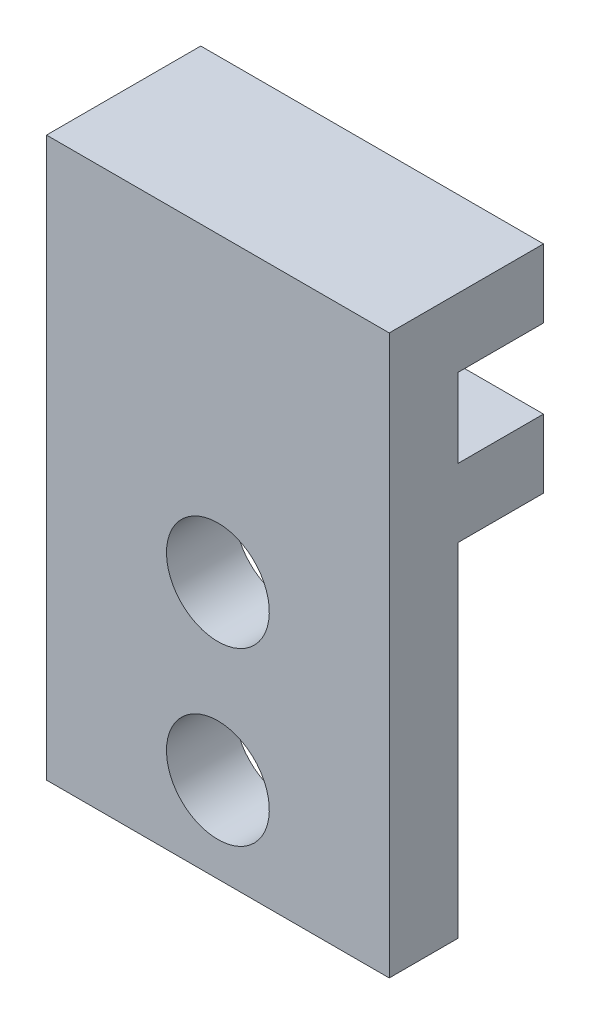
ISO-10303-21;
HEADER;
FILE_DESCRIPTION(('STEP AP214'),'2;1');
FILE_NAME('part.step','',(''),(''),'','','');
FILE_SCHEMA(('AUTOMOTIVE_DESIGN { 1 0 10303 214 1 1 1 1 }'));
ENDSEC;
DATA;
#1=APPLICATION_CONTEXT('core data for automotive mechanical design processes');
#2=APPLICATION_PROTOCOL_DEFINITION('international standard','automotive_design',2000,#1);
#3=PRODUCT_CONTEXT('',#1,'mechanical');
#4=PRODUCT('Part','Part','',(#3));
#5=PRODUCT_RELATED_PRODUCT_CATEGORY('part','',(#4));
#6=PRODUCT_DEFINITION_FORMATION('','',#4);
#7=PRODUCT_DEFINITION_CONTEXT('part definition',#1,'design');
#8=PRODUCT_DEFINITION('design','',#6,#7);
#9=PRODUCT_DEFINITION_SHAPE('','',#8);
#10=(LENGTH_UNIT() NAMED_UNIT(*) SI_UNIT(.MILLI.,.METRE.));
#11=(NAMED_UNIT(*) PLANE_ANGLE_UNIT() SI_UNIT($,.RADIAN.));
#12=(NAMED_UNIT(*) SI_UNIT($,.STERADIAN.) SOLID_ANGLE_UNIT());
#13=UNCERTAINTY_MEASURE_WITH_UNIT(LENGTH_MEASURE(1.E-05),#10,'distance_accuracy_value','');
#14=(GEOMETRIC_REPRESENTATION_CONTEXT(3) GLOBAL_UNCERTAINTY_ASSIGNED_CONTEXT((#13)) GLOBAL_UNIT_ASSIGNED_CONTEXT((#10,
#11,#12)) REPRESENTATION_CONTEXT('',''));
#15=CARTESIAN_POINT('',(0.,0.,0.));
#16=DIRECTION('',(0.,0.,1.));
#17=DIRECTION('',(1.,0.,0.));
#18=AXIS2_PLACEMENT_3D('',#15,#16,#17);
#19=CARTESIAN_POINT('',(20.,-32.6,0.));
#20=DIRECTION('',(0.,0.,-1.));
#21=DIRECTION('',(0.,1.,0.));
#22=AXIS2_PLACEMENT_3D('',#19,#20,#21);
#23=PLANE('',#22);
#24=CARTESIAN_POINT('',(10.,-17.6,0.));
#25=DIRECTION('',(0.,0.,-1.));
#26=DIRECTION('',(0.,1.,0.));
#27=AXIS2_PLACEMENT_3D('',#24,#25,#26);
#28=CIRCLE('',#27,3.);
#29=CARTESIAN_POINT('',(10.,-14.6,0.));
#30=VERTEX_POINT('',#29);
#31=EDGE_CURVE('E163',#30,#30,#28,.T.);
#32=ORIENTED_EDGE('',*,*,#31,.T.);
#33=EDGE_LOOP('',(#32));
#34=FACE_BOUND('',#33,.T.);
#35=CARTESIAN_POINT('',(10.,-27.6,0.));
#36=DIRECTION('',(0.,0.,-1.));
#37=DIRECTION('',(0.,1.,0.));
#38=AXIS2_PLACEMENT_3D('',#35,#36,#37);
#39=CIRCLE('',#38,3.);
#40=CARTESIAN_POINT('',(10.,-24.6,0.));
#41=VERTEX_POINT('',#40);
#42=EDGE_CURVE('E249',#41,#41,#39,.T.);
#43=ORIENTED_EDGE('',*,*,#42,.T.);
#44=EDGE_LOOP('',(#43));
#45=FACE_BOUND('',#44,.T.);
#46=DIRECTION('',(0.,-1.,0.));
#47=VECTOR('',#46,1.);
#48=CARTESIAN_POINT('',(0.,-32.6,0.));
#49=LINE('',#48,#47);
#50=CARTESIAN_POINT('',(0.,0.,0.));
#51=VERTEX_POINT('',#50);
#52=CARTESIAN_POINT('',(0.,-32.6,0.));
#53=VERTEX_POINT('',#52);
#54=EDGE_CURVE('E158',#51,#53,#49,.T.);
#55=ORIENTED_EDGE('',*,*,#54,.T.);
#56=DIRECTION('',(-1.,0.,0.));
#57=VECTOR('',#56,1.);
#58=CARTESIAN_POINT('',(20.,-32.6,0.));
#59=LINE('',#58,#57);
#60=CARTESIAN_POINT('',(20.,-32.6,0.));
#61=VERTEX_POINT('',#60);
#62=EDGE_CURVE('E11',#61,#53,#59,.T.);
#63=ORIENTED_EDGE('',*,*,#62,.F.);
#64=DIRECTION('',(0.,-1.,0.));
#65=VECTOR('',#64,1.);
#66=CARTESIAN_POINT('',(20.,-32.6,0.));
#67=LINE('',#66,#65);
#68=CARTESIAN_POINT('',(20.,0.,0.));
#69=VERTEX_POINT('',#68);
#70=EDGE_CURVE('E187',#69,#61,#67,.T.);
#71=ORIENTED_EDGE('',*,*,#70,.F.);
#72=DIRECTION('',(-1.,0.,0.));
#73=VECTOR('',#72,1.);
#74=CARTESIAN_POINT('',(20.,0.,0.));
#75=LINE('',#74,#73);
#76=EDGE_CURVE('E154',#69,#51,#75,.T.);
#77=ORIENTED_EDGE('',*,*,#76,.T.);
#78=EDGE_LOOP('',(#55,#63,#71,#77));
#79=FACE_BOUND('',#78,.T.);
#80=ADVANCED_FACE('F45',(#34,#45,#79),#23,.F.);
#81=CARTESIAN_POINT('',(20.,-32.6,-4.00000000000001));
#82=DIRECTION('',(0.,1.,0.));
#83=DIRECTION('',(0.,0.,1.));
#84=AXIS2_PLACEMENT_3D('',#81,#82,#83);
#85=PLANE('',#84);
#86=DIRECTION('',(0.,0.,-1.));
#87=VECTOR('',#86,1.);
#88=CARTESIAN_POINT('',(0.,-32.6,-4.00000000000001));
#89=LINE('',#88,#87);
#90=CARTESIAN_POINT('',(0.,-32.6,-4.00000000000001));
#91=VERTEX_POINT('',#90);
#92=EDGE_CURVE('E162',#53,#91,#89,.T.);
#93=ORIENTED_EDGE('',*,*,#92,.T.);
#94=DIRECTION('',(-1.,0.,0.));
#95=VECTOR('',#94,1.);
#96=CARTESIAN_POINT('',(20.,-32.6,-4.00000000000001));
#97=LINE('',#96,#95);
#98=CARTESIAN_POINT('',(20.,-32.6,-4.00000000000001));
#99=VERTEX_POINT('',#98);
#100=EDGE_CURVE('E54',#99,#91,#97,.T.);
#101=ORIENTED_EDGE('',*,*,#100,.F.);
#102=DIRECTION('',(0.,0.,-1.));
#103=VECTOR('',#102,1.);
#104=CARTESIAN_POINT('',(20.,-32.6,-4.00000000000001));
#105=LINE('',#104,#103);
#106=EDGE_CURVE('E111',#61,#99,#105,.T.);
#107=ORIENTED_EDGE('',*,*,#106,.F.);
#108=ORIENTED_EDGE('',*,*,#62,.T.);
#109=EDGE_LOOP('',(#93,#101,#107,#108));
#110=FACE_BOUND('',#109,.T.);
#111=ADVANCED_FACE('F276',(#110),#85,.F.);
#112=CARTESIAN_POINT('',(20.,-12.6,-4.));
#113=DIRECTION('',(0.,0.,1.));
#114=DIRECTION('',(0.,-1.,0.));
#115=AXIS2_PLACEMENT_3D('',#112,#113,#114);
#116=PLANE('',#115);
#117=CARTESIAN_POINT('',(10.,-17.6,-4.00000000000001));
#118=DIRECTION('',(0.,0.,-1.));
#119=DIRECTION('',(0.,1.,0.));
#120=AXIS2_PLACEMENT_3D('',#117,#118,#119);
#121=CIRCLE('',#120,3.);
#122=CARTESIAN_POINT('',(10.,-14.6,-4.00000000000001));
#123=VERTEX_POINT('',#122);
#124=EDGE_CURVE('E257',#123,#123,#121,.T.);
#125=ORIENTED_EDGE('',*,*,#124,.F.);
#126=EDGE_LOOP('',(#125));
#127=FACE_BOUND('',#126,.T.);
#128=CARTESIAN_POINT('',(10.,-27.6,-4.00000000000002));
#129=DIRECTION('',(0.,0.,-1.));
#130=DIRECTION('',(0.,1.,0.));
#131=AXIS2_PLACEMENT_3D('',#128,#129,#130);
#132=CIRCLE('',#131,3.);
#133=CARTESIAN_POINT('',(10.,-24.6,-4.00000000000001));
#134=VERTEX_POINT('',#133);
#135=EDGE_CURVE('E253',#134,#134,#132,.T.);
#136=ORIENTED_EDGE('',*,*,#135,.F.);
#137=EDGE_LOOP('',(#136));
#138=FACE_BOUND('',#137,.T.);
#139=DIRECTION('',(0.,1.,0.));
#140=VECTOR('',#139,1.);
#141=CARTESIAN_POINT('',(0.,-12.6,-4.));
#142=LINE('',#141,#140);
#143=CARTESIAN_POINT('',(0.,-12.6,-4.));
#144=VERTEX_POINT('',#143);
#145=EDGE_CURVE('E166',#91,#144,#142,.T.);
#146=ORIENTED_EDGE('',*,*,#145,.T.);
#147=DIRECTION('',(-1.,0.,0.));
#148=VECTOR('',#147,1.);
#149=CARTESIAN_POINT('',(20.,-12.6,-4.));
#150=LINE('',#149,#148);
#151=CARTESIAN_POINT('',(20.,-12.6,-4.));
#152=VERTEX_POINT('',#151);
#153=EDGE_CURVE('E206',#152,#144,#150,.T.);
#154=ORIENTED_EDGE('',*,*,#153,.F.);
#155=DIRECTION('',(0.,1.,0.));
#156=VECTOR('',#155,1.);
#157=CARTESIAN_POINT('',(20.,-12.6,-4.));
#158=LINE('',#157,#156);
#159=EDGE_CURVE('E216',#99,#152,#158,.T.);
#160=ORIENTED_EDGE('',*,*,#159,.F.);
#161=ORIENTED_EDGE('',*,*,#100,.T.);
#162=EDGE_LOOP('',(#146,#154,#160,#161));
#163=FACE_BOUND('',#162,.T.);
#164=ADVANCED_FACE('F214',(#127,#138,#163),#116,.F.);
#165=CARTESIAN_POINT('',(20.,-12.6,-9.00000000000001));
#166=DIRECTION('',(0.,1.,0.));
#167=DIRECTION('',(0.,0.,1.));
#168=AXIS2_PLACEMENT_3D('',#165,#166,#167);
#169=PLANE('',#168);
#170=DIRECTION('',(0.,0.,-1.));
#171=VECTOR('',#170,1.);
#172=CARTESIAN_POINT('',(0.,-12.6,-9.00000000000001));
#173=LINE('',#172,#171);
#174=CARTESIAN_POINT('',(0.,-12.6,-9.00000000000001));
#175=VERTEX_POINT('',#174);
#176=EDGE_CURVE('E169',#144,#175,#173,.T.);
#177=ORIENTED_EDGE('',*,*,#176,.T.);
#178=DIRECTION('',(-1.,0.,0.));
#179=VECTOR('',#178,1.);
#180=CARTESIAN_POINT('',(20.,-12.6,-9.00000000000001));
#181=LINE('',#180,#179);
#182=CARTESIAN_POINT('',(20.,-12.6,-9.00000000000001));
#183=VERTEX_POINT('',#182);
#184=EDGE_CURVE('E202',#183,#175,#181,.T.);
#185=ORIENTED_EDGE('',*,*,#184,.F.);
#186=DIRECTION('',(0.,0.,-1.));
#187=VECTOR('',#186,1.);
#188=CARTESIAN_POINT('',(20.,-12.6,-9.00000000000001));
#189=LINE('',#188,#187);
#190=EDGE_CURVE('E235',#152,#183,#189,.T.);
#191=ORIENTED_EDGE('',*,*,#190,.F.);
#192=ORIENTED_EDGE('',*,*,#153,.T.);
#193=EDGE_LOOP('',(#177,#185,#191,#192));
#194=FACE_BOUND('',#193,.T.);
#195=ADVANCED_FACE('F225',(#194),#169,.F.);
#196=CARTESIAN_POINT('',(20.,-8.6,-9.));
#197=DIRECTION('',(0.,0.,1.));
#198=DIRECTION('',(0.,-1.,0.));
#199=AXIS2_PLACEMENT_3D('',#196,#197,#198);
#200=PLANE('',#199);
#201=DIRECTION('',(0.,1.,0.));
#202=VECTOR('',#201,1.);
#203=CARTESIAN_POINT('',(0.,-8.6,-9.));
#204=LINE('',#203,#202);
#205=CARTESIAN_POINT('',(0.,-8.6,-9.));
#206=VERTEX_POINT('',#205);
#207=EDGE_CURVE('E172',#175,#206,#204,.T.);
#208=ORIENTED_EDGE('',*,*,#207,.T.);
#209=DIRECTION('',(-1.,0.,0.));
#210=VECTOR('',#209,1.);
#211=CARTESIAN_POINT('',(20.,-8.6,-9.));
#212=LINE('',#211,#210);
#213=CARTESIAN_POINT('',(20.,-8.6,-9.));
#214=VERTEX_POINT('',#213);
#215=EDGE_CURVE('E198',#214,#206,#212,.T.);
#216=ORIENTED_EDGE('',*,*,#215,.F.);
#217=DIRECTION('',(0.,1.,0.));
#218=VECTOR('',#217,1.);
#219=CARTESIAN_POINT('',(20.,-8.6,-9.));
#220=LINE('',#219,#218);
#221=EDGE_CURVE('E231',#183,#214,#220,.T.);
#222=ORIENTED_EDGE('',*,*,#221,.F.);
#223=ORIENTED_EDGE('',*,*,#184,.T.);
#224=EDGE_LOOP('',(#208,#216,#222,#223));
#225=FACE_BOUND('',#224,.T.);
#226=ADVANCED_FACE('F229',(#225),#200,.F.);
#227=CARTESIAN_POINT('',(20.,-8.6,-4.));
#228=DIRECTION('',(0.,-1.,0.));
#229=DIRECTION('',(0.,0.,-1.));
#230=AXIS2_PLACEMENT_3D('',#227,#228,#229);
#231=PLANE('',#230);
#232=DIRECTION('',(0.,0.,1.));
#233=VECTOR('',#232,1.);
#234=CARTESIAN_POINT('',(0.,-8.6,-4.));
#235=LINE('',#234,#233);
#236=CARTESIAN_POINT('',(0.,-8.6,-4.));
#237=VERTEX_POINT('',#236);
#238=EDGE_CURVE('E175',#206,#237,#235,.T.);
#239=ORIENTED_EDGE('',*,*,#238,.T.);
#240=DIRECTION('',(-1.,0.,0.));
#241=VECTOR('',#240,1.);
#242=CARTESIAN_POINT('',(20.,-8.6,-4.));
#243=LINE('',#242,#241);
#244=CARTESIAN_POINT('',(20.,-8.6,-4.));
#245=VERTEX_POINT('',#244);
#246=EDGE_CURVE('E194',#245,#237,#243,.T.);
#247=ORIENTED_EDGE('',*,*,#246,.F.);
#248=DIRECTION('',(0.,0.,1.));
#249=VECTOR('',#248,1.);
#250=CARTESIAN_POINT('',(20.,-8.6,-4.));
#251=LINE('',#250,#249);
#252=EDGE_CURVE('E234',#214,#245,#251,.T.);
#253=ORIENTED_EDGE('',*,*,#252,.F.);
#254=ORIENTED_EDGE('',*,*,#215,.T.);
#255=EDGE_LOOP('',(#239,#247,#253,#254));
#256=FACE_BOUND('',#255,.T.);
#257=ADVANCED_FACE('F300',(#256),#231,.F.);
#258=CARTESIAN_POINT('',(20.,-4.,-4.));
#259=DIRECTION('',(0.,0.,1.));
#260=DIRECTION('',(0.,-1.,0.));
#261=AXIS2_PLACEMENT_3D('',#258,#259,#260);
#262=PLANE('',#261);
#263=DIRECTION('',(0.,1.,0.));
#264=VECTOR('',#263,1.);
#265=CARTESIAN_POINT('',(0.,-4.,-4.));
#266=LINE('',#265,#264);
#267=CARTESIAN_POINT('',(0.,-4.,-4.));
#268=VERTEX_POINT('',#267);
#269=EDGE_CURVE('E178',#237,#268,#266,.T.);
#270=ORIENTED_EDGE('',*,*,#269,.T.);
#271=DIRECTION('',(-1.,0.,0.));
#272=VECTOR('',#271,1.);
#273=CARTESIAN_POINT('',(20.,-4.,-4.));
#274=LINE('',#273,#272);
#275=CARTESIAN_POINT('',(20.,-4.,-4.));
#276=VERTEX_POINT('',#275);
#277=EDGE_CURVE('E147',#276,#268,#274,.T.);
#278=ORIENTED_EDGE('',*,*,#277,.F.);
#279=DIRECTION('',(0.,1.,0.));
#280=VECTOR('',#279,1.);
#281=CARTESIAN_POINT('',(20.,-4.,-4.));
#282=LINE('',#281,#280);
#283=EDGE_CURVE('E136',#245,#276,#282,.T.);
#284=ORIENTED_EDGE('',*,*,#283,.F.);
#285=ORIENTED_EDGE('',*,*,#246,.T.);
#286=EDGE_LOOP('',(#270,#278,#284,#285));
#287=FACE_BOUND('',#286,.T.);
#288=ADVANCED_FACE('F303',(#287),#262,.F.);
#289=CARTESIAN_POINT('',(20.,-4.,-9.));
#290=DIRECTION('',(0.,1.,0.));
#291=DIRECTION('',(0.,0.,1.));
#292=AXIS2_PLACEMENT_3D('',#289,#290,#291);
#293=PLANE('',#292);
#294=DIRECTION('',(0.,0.,-1.));
#295=VECTOR('',#294,1.);
#296=CARTESIAN_POINT('',(0.,-4.,-9.));
#297=LINE('',#296,#295);
#298=CARTESIAN_POINT('',(0.,-4.,-9.));
#299=VERTEX_POINT('',#298);
#300=EDGE_CURVE('E145',#268,#299,#297,.T.);
#301=ORIENTED_EDGE('',*,*,#300,.T.);
#302=DIRECTION('',(-1.,0.,0.));
#303=VECTOR('',#302,1.);
#304=CARTESIAN_POINT('',(20.,-4.,-9.));
#305=LINE('',#304,#303);
#306=CARTESIAN_POINT('',(20.,-4.,-9.));
#307=VERTEX_POINT('',#306);
#308=EDGE_CURVE('E142',#307,#299,#305,.T.);
#309=ORIENTED_EDGE('',*,*,#308,.F.);
#310=DIRECTION('',(0.,0.,-1.));
#311=VECTOR('',#310,1.);
#312=CARTESIAN_POINT('',(20.,-4.,-9.));
#313=LINE('',#312,#311);
#314=EDGE_CURVE('E130',#276,#307,#313,.T.);
#315=ORIENTED_EDGE('',*,*,#314,.F.);
#316=ORIENTED_EDGE('',*,*,#277,.T.);
#317=EDGE_LOOP('',(#301,#309,#315,#316));
#318=FACE_BOUND('',#317,.T.);
#319=ADVANCED_FACE('F143',(#318),#293,.F.);
#320=CARTESIAN_POINT('',(20.,0.,-9.));
#321=DIRECTION('',(0.,0.,1.));
#322=DIRECTION('',(1.,0.,0.));
#323=AXIS2_PLACEMENT_3D('',#320,#321,#322);
#324=PLANE('',#323);
#325=DIRECTION('',(0.,1.,0.));
#326=VECTOR('',#325,1.);
#327=CARTESIAN_POINT('',(0.,0.,-9.));
#328=LINE('',#327,#326);
#329=CARTESIAN_POINT('',(0.,0.,-9.));
#330=VERTEX_POINT('',#329);
#331=EDGE_CURVE('E97',#299,#330,#328,.T.);
#332=ORIENTED_EDGE('',*,*,#331,.T.);
#333=DIRECTION('',(-1.,0.,0.));
#334=VECTOR('',#333,1.);
#335=CARTESIAN_POINT('',(20.,0.,-9.));
#336=LINE('',#335,#334);
#337=CARTESIAN_POINT('',(20.,0.,-9.));
#338=VERTEX_POINT('',#337);
#339=EDGE_CURVE('E148',#338,#330,#336,.T.);
#340=ORIENTED_EDGE('',*,*,#339,.F.);
#341=DIRECTION('',(0.,1.,0.));
#342=VECTOR('',#341,1.);
#343=CARTESIAN_POINT('',(20.,0.,-9.));
#344=LINE('',#343,#342);
#345=EDGE_CURVE('E134',#307,#338,#344,.T.);
#346=ORIENTED_EDGE('',*,*,#345,.F.);
#347=ORIENTED_EDGE('',*,*,#308,.T.);
#348=EDGE_LOOP('',(#332,#340,#346,#347));
#349=FACE_BOUND('',#348,.T.);
#350=ADVANCED_FACE('F150',(#349),#324,.F.);
#351=CARTESIAN_POINT('',(20.,0.,0.));
#352=DIRECTION('',(0.,-1.,0.));
#353=DIRECTION('',(0.,0.,-1.));
#354=AXIS2_PLACEMENT_3D('',#351,#352,#353);
#355=PLANE('',#354);
#356=DIRECTION('',(0.,0.,1.));
#357=VECTOR('',#356,1.);
#358=CARTESIAN_POINT('',(0.,0.,0.));
#359=LINE('',#358,#357);
#360=EDGE_CURVE('E103',#330,#51,#359,.T.);
#361=ORIENTED_EDGE('',*,*,#360,.T.);
#362=ORIENTED_EDGE('',*,*,#76,.F.);
#363=DIRECTION('',(0.,0.,1.));
#364=VECTOR('',#363,1.);
#365=CARTESIAN_POINT('',(20.,0.,0.));
#366=LINE('',#365,#364);
#367=EDGE_CURVE('E62',#338,#69,#366,.T.);
#368=ORIENTED_EDGE('',*,*,#367,.F.);
#369=ORIENTED_EDGE('',*,*,#339,.T.);
#370=EDGE_LOOP('',(#361,#362,#368,#369));
#371=FACE_BOUND('',#370,.T.);
#372=ADVANCED_FACE('F312',(#371),#355,.F.);
#373=CARTESIAN_POINT('',(20.,0.,0.));
#374=DIRECTION('',(-1.,0.,0.));
#375=DIRECTION('',(0.,0.,1.));
#376=AXIS2_PLACEMENT_3D('',#373,#374,#375);
#377=PLANE('',#376);
#378=ORIENTED_EDGE('',*,*,#70,.T.);
#379=ORIENTED_EDGE('',*,*,#106,.T.);
#380=ORIENTED_EDGE('',*,*,#159,.T.);
#381=ORIENTED_EDGE('',*,*,#190,.T.);
#382=ORIENTED_EDGE('',*,*,#221,.T.);
#383=ORIENTED_EDGE('',*,*,#252,.T.);
#384=ORIENTED_EDGE('',*,*,#283,.T.);
#385=ORIENTED_EDGE('',*,*,#314,.T.);
#386=ORIENTED_EDGE('',*,*,#345,.T.);
#387=ORIENTED_EDGE('',*,*,#367,.T.);
#388=EDGE_LOOP('',(#378,#379,#380,#381,#382,#383,#384,#385,#386,#387));
#389=FACE_BOUND('',#388,.T.);
#390=ADVANCED_FACE('F132',(#389),#377,.F.);
#391=CARTESIAN_POINT('',(0.,0.,0.));
#392=DIRECTION('',(-1.,0.,0.));
#393=DIRECTION('',(0.,0.,1.));
#394=AXIS2_PLACEMENT_3D('',#391,#392,#393);
#395=PLANE('',#394);
#396=ORIENTED_EDGE('',*,*,#54,.F.);
#397=ORIENTED_EDGE('',*,*,#360,.F.);
#398=ORIENTED_EDGE('',*,*,#331,.F.);
#399=ORIENTED_EDGE('',*,*,#300,.F.);
#400=ORIENTED_EDGE('',*,*,#269,.F.);
#401=ORIENTED_EDGE('',*,*,#238,.F.);
#402=ORIENTED_EDGE('',*,*,#207,.F.);
#403=ORIENTED_EDGE('',*,*,#176,.F.);
#404=ORIENTED_EDGE('',*,*,#145,.F.);
#405=ORIENTED_EDGE('',*,*,#92,.F.);
#406=EDGE_LOOP('',(#396,#397,#398,#399,#400,#401,#402,#403,#404,#405));
#407=FACE_BOUND('',#406,.T.);
#408=ADVANCED_FACE('F220',(#407),#395,.T.);
#409=CARTESIAN_POINT('',(10.,-27.6,0.));
#410=DIRECTION('',(0.,0.,-1.));
#411=DIRECTION('',(0.,1.,0.));
#412=AXIS2_PLACEMENT_3D('',#409,#410,#411);
#413=CYLINDRICAL_SURFACE('',#412,3.);
#414=ORIENTED_EDGE('',*,*,#42,.F.);
#415=EDGE_LOOP('',(#414));
#416=FACE_BOUND('',#415,.T.);
#417=ORIENTED_EDGE('',*,*,#135,.T.);
#418=EDGE_LOOP('',(#417));
#419=FACE_BOUND('',#418,.T.);
#420=ADVANCED_FACE('F270',(#416,#419),#413,.F.);
#421=CARTESIAN_POINT('',(10.,-17.6,0.));
#422=DIRECTION('',(0.,0.,-1.));
#423=DIRECTION('',(0.,1.,0.));
#424=AXIS2_PLACEMENT_3D('',#421,#422,#423);
#425=CYLINDRICAL_SURFACE('',#424,3.);
#426=ORIENTED_EDGE('',*,*,#31,.F.);
#427=EDGE_LOOP('',(#426));
#428=FACE_BOUND('',#427,.T.);
#429=ORIENTED_EDGE('',*,*,#124,.T.);
#430=EDGE_LOOP('',(#429));
#431=FACE_BOUND('',#430,.T.);
#432=ADVANCED_FACE('F267',(#428,#431),#425,.F.);
#433=CLOSED_SHELL('',(#80,#111,#164,#195,#226,#257,#288,#319,#350,#372,#390,#408,#420,#432));
#434=MANIFOLD_SOLID_BREP('B2',#433);
#435=ADVANCED_BREP_SHAPE_REPRESENTATION('',(#18,#434),#14);
#436=SHAPE_DEFINITION_REPRESENTATION(#9,#435);
ENDSEC;
END-ISO-10303-21;
